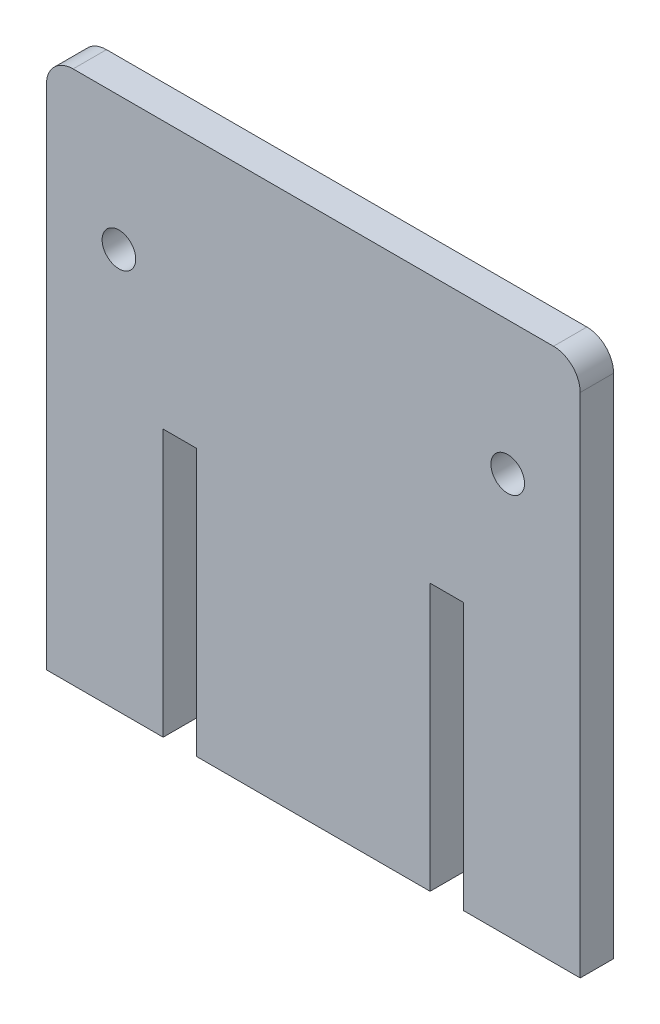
ISO-10303-21;
HEADER;
FILE_DESCRIPTION(('STEP AP214'),'2;1');
FILE_NAME('part.step','',(''),(''),'','','');
FILE_SCHEMA(('AUTOMOTIVE_DESIGN { 1 0 10303 214 1 1 1 1 }'));
ENDSEC;
DATA;
#1=APPLICATION_CONTEXT('core data for automotive mechanical design processes');
#2=APPLICATION_PROTOCOL_DEFINITION('international standard','automotive_design',2000,#1);
#3=PRODUCT_CONTEXT('',#1,'mechanical');
#4=PRODUCT('Part','Part','',(#3));
#5=PRODUCT_RELATED_PRODUCT_CATEGORY('part','',(#4));
#6=PRODUCT_DEFINITION_FORMATION('','',#4);
#7=PRODUCT_DEFINITION_CONTEXT('part definition',#1,'design');
#8=PRODUCT_DEFINITION('design','',#6,#7);
#9=PRODUCT_DEFINITION_SHAPE('','',#8);
#10=(LENGTH_UNIT() NAMED_UNIT(*) SI_UNIT(.MILLI.,.METRE.));
#11=(NAMED_UNIT(*) PLANE_ANGLE_UNIT() SI_UNIT($,.RADIAN.));
#12=(NAMED_UNIT(*) SI_UNIT($,.STERADIAN.) SOLID_ANGLE_UNIT());
#13=UNCERTAINTY_MEASURE_WITH_UNIT(LENGTH_MEASURE(1.E-05),#10,'distance_accuracy_value','');
#14=(GEOMETRIC_REPRESENTATION_CONTEXT(3) GLOBAL_UNCERTAINTY_ASSIGNED_CONTEXT((#13)) GLOBAL_UNIT_ASSIGNED_CONTEXT((#10,
#11,#12)) REPRESENTATION_CONTEXT('',''));
#15=CARTESIAN_POINT('',(0.,0.,0.));
#16=DIRECTION('',(0.,0.,1.));
#17=DIRECTION('',(1.,0.,0.));
#18=AXIS2_PLACEMENT_3D('',#15,#16,#17);
#19=CARTESIAN_POINT('',(-25.4,-25.4,1.5875));
#20=DIRECTION('',(0.,1.,0.));
#21=DIRECTION('',(0.,0.,1.));
#22=AXIS2_PLACEMENT_3D('',#19,#20,#21);
#23=PLANE('',#22);
#24=DIRECTION('',(1.,0.,0.));
#25=VECTOR('',#24,1.);
#26=CARTESIAN_POINT('',(-25.4,-25.4,1.5875));
#27=LINE('',#26,#25);
#28=CARTESIAN_POINT('',(14.2875,-25.4,1.5875));
#29=VERTEX_POINT('',#28);
#30=CARTESIAN_POINT('',(25.4,-25.4,1.5875));
#31=VERTEX_POINT('',#30);
#32=EDGE_CURVE('E213',#29,#31,#27,.T.);
#33=ORIENTED_EDGE('',*,*,#32,.F.);
#34=DIRECTION('',(0.,0.,1.));
#35=VECTOR('',#34,1.);
#36=CARTESIAN_POINT('',(14.2875,-25.4,-1.5875));
#37=LINE('',#36,#35);
#38=CARTESIAN_POINT('',(14.2875,-25.4,-1.5875));
#39=VERTEX_POINT('',#38);
#40=EDGE_CURVE('E173',#39,#29,#37,.T.);
#41=ORIENTED_EDGE('',*,*,#40,.F.);
#42=DIRECTION('',(1.,0.,0.));
#43=VECTOR('',#42,1.);
#44=CARTESIAN_POINT('',(-25.4,-25.4,-1.5875));
#45=LINE('',#44,#43);
#46=CARTESIAN_POINT('',(25.4,-25.4,-1.5875));
#47=VERTEX_POINT('',#46);
#48=EDGE_CURVE('E160',#39,#47,#45,.T.);
#49=ORIENTED_EDGE('',*,*,#48,.T.);
#50=DIRECTION('',(0.,0.,-1.));
#51=VECTOR('',#50,1.);
#52=CARTESIAN_POINT('',(25.4,-25.4,1.5875));
#53=LINE('',#52,#51);
#54=EDGE_CURVE('E217',#31,#47,#53,.T.);
#55=ORIENTED_EDGE('',*,*,#54,.F.);
#56=EDGE_LOOP('',(#33,#41,#49,#55));
#57=FACE_BOUND('',#56,.T.);
#58=ADVANCED_FACE('F32',(#57),#23,.F.);
#59=CARTESIAN_POINT('',(-11.1125,-25.4,-1.5875));
#60=VERTEX_POINT('',#59);
#61=CARTESIAN_POINT('',(11.1125,-25.4,-1.5875));
#62=VERTEX_POINT('',#61);
#63=EDGE_CURVE('E227',#60,#62,#45,.T.);
#64=ORIENTED_EDGE('',*,*,#63,.T.);
#65=DIRECTION('',(0.,0.,1.));
#66=VECTOR('',#65,1.);
#67=CARTESIAN_POINT('',(11.1125,-25.4,-1.5875));
#68=LINE('',#67,#66);
#69=CARTESIAN_POINT('',(11.1125,-25.4,1.5875));
#70=VERTEX_POINT('',#69);
#71=EDGE_CURVE('E176',#62,#70,#68,.T.);
#72=ORIENTED_EDGE('',*,*,#71,.T.);
#73=CARTESIAN_POINT('',(-11.1125,-25.4,1.5875));
#74=VERTEX_POINT('',#73);
#75=EDGE_CURVE('E218',#74,#70,#27,.T.);
#76=ORIENTED_EDGE('',*,*,#75,.F.);
#77=DIRECTION('',(0.,0.,1.));
#78=VECTOR('',#77,1.);
#79=CARTESIAN_POINT('',(-11.1125,-25.4,-1.5875));
#80=LINE('',#79,#78);
#81=EDGE_CURVE('E197',#60,#74,#80,.T.);
#82=ORIENTED_EDGE('',*,*,#81,.F.);
#83=EDGE_LOOP('',(#64,#72,#76,#82));
#84=FACE_BOUND('',#83,.T.);
#85=ADVANCED_FACE('F260',(#84),#23,.F.);
#86=CARTESIAN_POINT('',(25.4,25.4,1.5875));
#87=DIRECTION('',(-1.,0.,0.));
#88=DIRECTION('',(0.,-1.,0.));
#89=AXIS2_PLACEMENT_3D('',#86,#87,#88);
#90=PLANE('',#89);
#91=DIRECTION('',(0.,1.,0.));
#92=VECTOR('',#91,1.);
#93=CARTESIAN_POINT('',(25.4,25.4,-1.5875));
#94=LINE('',#93,#92);
#95=CARTESIAN_POINT('',(25.4,22.86,-1.5875));
#96=VERTEX_POINT('',#95);
#97=EDGE_CURVE('E199',#47,#96,#94,.T.);
#98=ORIENTED_EDGE('',*,*,#97,.T.);
#99=DIRECTION('',(0.,0.,-1.));
#100=VECTOR('',#99,1.);
#101=CARTESIAN_POINT('',(25.4,22.86,1.5875));
#102=LINE('',#101,#100);
#103=CARTESIAN_POINT('',(25.4,22.86,1.5875));
#104=VERTEX_POINT('',#103);
#105=EDGE_CURVE('E55',#96,#104,#102,.F.);
#106=ORIENTED_EDGE('',*,*,#105,.T.);
#107=DIRECTION('',(0.,1.,0.));
#108=VECTOR('',#107,1.);
#109=CARTESIAN_POINT('',(25.4,25.4,1.5875));
#110=LINE('',#109,#108);
#111=EDGE_CURVE('E206',#31,#104,#110,.T.);
#112=ORIENTED_EDGE('',*,*,#111,.F.);
#113=ORIENTED_EDGE('',*,*,#54,.T.);
#114=EDGE_LOOP('',(#98,#106,#112,#113));
#115=FACE_BOUND('',#114,.T.);
#116=ADVANCED_FACE('F252',(#115),#90,.F.);
#117=CARTESIAN_POINT('',(-25.4,25.4,1.5875));
#118=DIRECTION('',(0.,-1.,0.));
#119=DIRECTION('',(0.,0.,-1.));
#120=AXIS2_PLACEMENT_3D('',#117,#118,#119);
#121=PLANE('',#120);
#122=DIRECTION('',(-1.,0.,0.));
#123=VECTOR('',#122,1.);
#124=CARTESIAN_POINT('',(-25.4,25.4,1.5875));
#125=LINE('',#124,#123);
#126=CARTESIAN_POINT('',(22.86,25.4,1.5875));
#127=VERTEX_POINT('',#126);
#128=CARTESIAN_POINT('',(-22.86,25.4,1.5875));
#129=VERTEX_POINT('',#128);
#130=EDGE_CURVE('E208',#127,#129,#125,.T.);
#131=ORIENTED_EDGE('',*,*,#130,.F.);
#132=DIRECTION('',(0.,0.,-1.));
#133=VECTOR('',#132,1.);
#134=CARTESIAN_POINT('',(22.86,25.4,1.5875));
#135=LINE('',#134,#133);
#136=CARTESIAN_POINT('',(22.86,25.4,-1.5875));
#137=VERTEX_POINT('',#136);
#138=EDGE_CURVE('E235',#127,#137,#135,.T.);
#139=ORIENTED_EDGE('',*,*,#138,.T.);
#140=DIRECTION('',(-1.,0.,0.));
#141=VECTOR('',#140,1.);
#142=CARTESIAN_POINT('',(-25.4,25.4,-1.5875));
#143=LINE('',#142,#141);
#144=CARTESIAN_POINT('',(-22.86,25.4,-1.5875));
#145=VERTEX_POINT('',#144);
#146=EDGE_CURVE('E220',#137,#145,#143,.T.);
#147=ORIENTED_EDGE('',*,*,#146,.T.);
#148=DIRECTION('',(0.,0.,-1.));
#149=VECTOR('',#148,1.);
#150=CARTESIAN_POINT('',(-22.86,25.4,1.5875));
#151=LINE('',#150,#149);
#152=EDGE_CURVE('E233',#145,#129,#151,.F.);
#153=ORIENTED_EDGE('',*,*,#152,.T.);
#154=EDGE_LOOP('',(#131,#139,#147,#153));
#155=FACE_BOUND('',#154,.T.);
#156=ADVANCED_FACE('F249',(#155),#121,.F.);
#157=CARTESIAN_POINT('',(-25.4,25.4,1.5875));
#158=DIRECTION('',(1.,0.,0.));
#159=DIRECTION('',(0.,1.,0.));
#160=AXIS2_PLACEMENT_3D('',#157,#158,#159);
#161=PLANE('',#160);
#162=DIRECTION('',(0.,-1.,0.));
#163=VECTOR('',#162,1.);
#164=CARTESIAN_POINT('',(-25.4,25.4,1.5875));
#165=LINE('',#164,#163);
#166=CARTESIAN_POINT('',(-25.4,22.86,1.5875));
#167=VERTEX_POINT('',#166);
#168=CARTESIAN_POINT('',(-25.4,-25.4,1.5875));
#169=VERTEX_POINT('',#168);
#170=EDGE_CURVE('E211',#167,#169,#165,.T.);
#171=ORIENTED_EDGE('',*,*,#170,.F.);
#172=DIRECTION('',(0.,0.,-1.));
#173=VECTOR('',#172,1.);
#174=CARTESIAN_POINT('',(-25.4,22.86,1.5875));
#175=LINE('',#174,#173);
#176=CARTESIAN_POINT('',(-25.4,22.86,-1.5875));
#177=VERTEX_POINT('',#176);
#178=EDGE_CURVE('E11',#167,#177,#175,.T.);
#179=ORIENTED_EDGE('',*,*,#178,.T.);
#180=DIRECTION('',(0.,-1.,0.));
#181=VECTOR('',#180,1.);
#182=CARTESIAN_POINT('',(-25.4,25.4,-1.5875));
#183=LINE('',#182,#181);
#184=CARTESIAN_POINT('',(-25.4,-25.4,-1.5875));
#185=VERTEX_POINT('',#184);
#186=EDGE_CURVE('E223',#177,#185,#183,.T.);
#187=ORIENTED_EDGE('',*,*,#186,.T.);
#188=DIRECTION('',(0.,0.,-1.));
#189=VECTOR('',#188,1.);
#190=CARTESIAN_POINT('',(-25.4,-25.4,1.5875));
#191=LINE('',#190,#189);
#192=EDGE_CURVE('E230',#169,#185,#191,.T.);
#193=ORIENTED_EDGE('',*,*,#192,.F.);
#194=EDGE_LOOP('',(#171,#179,#187,#193));
#195=FACE_BOUND('',#194,.T.);
#196=ADVANCED_FACE('F283',(#195),#161,.F.);
#197=CARTESIAN_POINT('',(-14.2875,-25.4,-1.5875));
#198=VERTEX_POINT('',#197);
#199=EDGE_CURVE('E209',#185,#198,#45,.T.);
#200=ORIENTED_EDGE('',*,*,#199,.T.);
#201=DIRECTION('',(0.,0.,1.));
#202=VECTOR('',#201,1.);
#203=CARTESIAN_POINT('',(-14.2875,-25.4,-1.5875));
#204=LINE('',#203,#202);
#205=CARTESIAN_POINT('',(-14.2875,-25.4,1.5875));
#206=VERTEX_POINT('',#205);
#207=EDGE_CURVE('E200',#198,#206,#204,.T.);
#208=ORIENTED_EDGE('',*,*,#207,.T.);
#209=EDGE_CURVE('E214',#169,#206,#27,.T.);
#210=ORIENTED_EDGE('',*,*,#209,.F.);
#211=ORIENTED_EDGE('',*,*,#192,.T.);
#212=EDGE_LOOP('',(#200,#208,#210,#211));
#213=FACE_BOUND('',#212,.T.);
#214=ADVANCED_FACE('F279',(#213),#23,.F.);
#215=CARTESIAN_POINT('',(25.4,-25.4,1.5875));
#216=DIRECTION('',(0.,0.,1.));
#217=DIRECTION('',(1.,0.,0.));
#218=AXIS2_PLACEMENT_3D('',#215,#216,#217);
#219=PLANE('',#218);
#220=CARTESIAN_POINT('',(18.50136,12.7,1.5875));
#221=DIRECTION('',(0.,0.,1.));
#222=DIRECTION('',(-1.,0.,0.));
#223=AXIS2_PLACEMENT_3D('',#220,#221,#222);
#224=CIRCLE('',#223,1.6002);
#225=CARTESIAN_POINT('',(16.90116,12.7,1.5875));
#226=VERTEX_POINT('',#225);
#227=EDGE_CURVE('E437',#226,#226,#224,.T.);
#228=ORIENTED_EDGE('',*,*,#227,.F.);
#229=EDGE_LOOP('',(#228));
#230=FACE_BOUND('',#229,.T.);
#231=CARTESIAN_POINT('',(-18.50136,12.7,1.5875));
#232=DIRECTION('',(0.,0.,1.));
#233=DIRECTION('',(1.,0.,0.));
#234=AXIS2_PLACEMENT_3D('',#231,#232,#233);
#235=CIRCLE('',#234,1.6002);
#236=CARTESIAN_POINT('',(-16.90116,12.7,1.5875));
#237=VERTEX_POINT('',#236);
#238=EDGE_CURVE('E166',#237,#237,#235,.T.);
#239=ORIENTED_EDGE('',*,*,#238,.F.);
#240=EDGE_LOOP('',(#239));
#241=FACE_BOUND('',#240,.T.);
#242=ORIENTED_EDGE('',*,*,#111,.T.);
#243=CARTESIAN_POINT('',(22.86,22.86,1.5875));
#244=DIRECTION('',(0.,0.,1.));
#245=DIRECTION('',(1.,0.,0.));
#246=AXIS2_PLACEMENT_3D('',#243,#244,#245);
#247=CIRCLE('',#246,2.54);
#248=EDGE_CURVE('E40',#104,#127,#247,.T.);
#249=ORIENTED_EDGE('',*,*,#248,.T.);
#250=ORIENTED_EDGE('',*,*,#130,.T.);
#251=CARTESIAN_POINT('',(-22.86,22.86,1.5875));
#252=DIRECTION('',(0.,0.,1.));
#253=DIRECTION('',(1.,0.,0.));
#254=AXIS2_PLACEMENT_3D('',#251,#252,#253);
#255=CIRCLE('',#254,2.54);
#256=EDGE_CURVE('E47',#129,#167,#255,.T.);
#257=ORIENTED_EDGE('',*,*,#256,.T.);
#258=ORIENTED_EDGE('',*,*,#170,.T.);
#259=ORIENTED_EDGE('',*,*,#209,.T.);
#260=DIRECTION('',(0.,-1.,0.));
#261=VECTOR('',#260,1.);
#262=CARTESIAN_POINT('',(-14.2875,0.,1.5875));
#263=LINE('',#262,#261);
#264=CARTESIAN_POINT('',(-14.2875,0.,1.5875));
#265=VERTEX_POINT('',#264);
#266=EDGE_CURVE('E184',#265,#206,#263,.T.);
#267=ORIENTED_EDGE('',*,*,#266,.F.);
#268=DIRECTION('',(-1.,0.,0.));
#269=VECTOR('',#268,1.);
#270=CARTESIAN_POINT('',(-14.2875,0.,1.5875));
#271=LINE('',#270,#269);
#272=CARTESIAN_POINT('',(-11.1125,0.,1.5875));
#273=VERTEX_POINT('',#272);
#274=EDGE_CURVE('E193',#273,#265,#271,.T.);
#275=ORIENTED_EDGE('',*,*,#274,.F.);
#276=DIRECTION('',(0.,1.,0.));
#277=VECTOR('',#276,1.);
#278=CARTESIAN_POINT('',(-11.1125,0.,1.5875));
#279=LINE('',#278,#277);
#280=EDGE_CURVE('E175',#74,#273,#279,.T.);
#281=ORIENTED_EDGE('',*,*,#280,.F.);
#282=ORIENTED_EDGE('',*,*,#75,.T.);
#283=DIRECTION('',(0.,-1.,0.));
#284=VECTOR('',#283,1.);
#285=CARTESIAN_POINT('',(11.1125,0.,1.5875));
#286=LINE('',#285,#284);
#287=CARTESIAN_POINT('',(11.1125,0.,1.5875));
#288=VERTEX_POINT('',#287);
#289=EDGE_CURVE('E161',#288,#70,#286,.T.);
#290=ORIENTED_EDGE('',*,*,#289,.F.);
#291=DIRECTION('',(-1.,0.,0.));
#292=VECTOR('',#291,1.);
#293=CARTESIAN_POINT('',(14.2875,0.,1.5875));
#294=LINE('',#293,#292);
#295=CARTESIAN_POINT('',(14.2875,0.,1.5875));
#296=VERTEX_POINT('',#295);
#297=EDGE_CURVE('E163',#296,#288,#294,.T.);
#298=ORIENTED_EDGE('',*,*,#297,.F.);
#299=DIRECTION('',(0.,1.,0.));
#300=VECTOR('',#299,1.);
#301=CARTESIAN_POINT('',(14.2875,0.,1.5875));
#302=LINE('',#301,#300);
#303=EDGE_CURVE('E142',#29,#296,#302,.T.);
#304=ORIENTED_EDGE('',*,*,#303,.F.);
#305=ORIENTED_EDGE('',*,*,#32,.T.);
#306=EDGE_LOOP('',(#242,#249,#250,#257,#258,#259,#267,#275,#281,#282,#290,#298,#304,#305));
#307=FACE_BOUND('',#306,.T.);
#308=ADVANCED_FACE('F245',(#230,#241,#307),#219,.T.);
#309=CARTESIAN_POINT('',(25.4,-25.4,-1.5875));
#310=DIRECTION('',(0.,0.,1.));
#311=DIRECTION('',(1.,0.,0.));
#312=AXIS2_PLACEMENT_3D('',#309,#310,#311);
#313=PLANE('',#312);
#314=CARTESIAN_POINT('',(18.50136,12.7,-1.5875));
#315=DIRECTION('',(0.,0.,1.));
#316=DIRECTION('',(-1.,0.,0.));
#317=AXIS2_PLACEMENT_3D('',#314,#315,#316);
#318=CIRCLE('',#317,1.6002);
#319=CARTESIAN_POINT('',(16.90116,12.7,-1.5875));
#320=VERTEX_POINT('',#319);
#321=EDGE_CURVE('E434',#320,#320,#318,.T.);
#322=ORIENTED_EDGE('',*,*,#321,.T.);
#323=EDGE_LOOP('',(#322));
#324=FACE_BOUND('',#323,.T.);
#325=CARTESIAN_POINT('',(-18.50136,12.7,-1.5875));
#326=DIRECTION('',(0.,0.,1.));
#327=DIRECTION('',(1.,0.,0.));
#328=AXIS2_PLACEMENT_3D('',#325,#326,#327);
#329=CIRCLE('',#328,1.6002);
#330=CARTESIAN_POINT('',(-16.90116,12.7,-1.5875));
#331=VERTEX_POINT('',#330);
#332=EDGE_CURVE('E171',#331,#331,#329,.T.);
#333=ORIENTED_EDGE('',*,*,#332,.T.);
#334=EDGE_LOOP('',(#333));
#335=FACE_BOUND('',#334,.T.);
#336=ORIENTED_EDGE('',*,*,#146,.F.);
#337=CARTESIAN_POINT('',(22.86,22.86,-1.5875));
#338=DIRECTION('',(0.,0.,1.));
#339=DIRECTION('',(1.,0.,0.));
#340=AXIS2_PLACEMENT_3D('',#337,#338,#339);
#341=CIRCLE('',#340,2.54);
#342=EDGE_CURVE('E240',#137,#96,#341,.F.);
#343=ORIENTED_EDGE('',*,*,#342,.T.);
#344=ORIENTED_EDGE('',*,*,#97,.F.);
#345=ORIENTED_EDGE('',*,*,#48,.F.);
#346=DIRECTION('',(0.,1.,0.));
#347=VECTOR('',#346,1.);
#348=CARTESIAN_POINT('',(14.2875,0.,-1.5875));
#349=LINE('',#348,#347);
#350=CARTESIAN_POINT('',(14.2875,0.,-1.5875));
#351=VERTEX_POINT('',#350);
#352=EDGE_CURVE('E139',#39,#351,#349,.T.);
#353=ORIENTED_EDGE('',*,*,#352,.T.);
#354=DIRECTION('',(-1.,0.,0.));
#355=VECTOR('',#354,1.);
#356=CARTESIAN_POINT('',(14.2875,0.,-1.5875));
#357=LINE('',#356,#355);
#358=CARTESIAN_POINT('',(11.1125,0.,-1.5875));
#359=VERTEX_POINT('',#358);
#360=EDGE_CURVE('E151',#351,#359,#357,.T.);
#361=ORIENTED_EDGE('',*,*,#360,.T.);
#362=DIRECTION('',(0.,-1.,0.));
#363=VECTOR('',#362,1.);
#364=CARTESIAN_POINT('',(11.1125,0.,-1.5875));
#365=LINE('',#364,#363);
#366=EDGE_CURVE('E147',#359,#62,#365,.T.);
#367=ORIENTED_EDGE('',*,*,#366,.T.);
#368=ORIENTED_EDGE('',*,*,#63,.F.);
#369=DIRECTION('',(0.,1.,0.));
#370=VECTOR('',#369,1.);
#371=CARTESIAN_POINT('',(-11.1125,0.,-1.5875));
#372=LINE('',#371,#370);
#373=CARTESIAN_POINT('',(-11.1125,0.,-1.5875));
#374=VERTEX_POINT('',#373);
#375=EDGE_CURVE('E180',#60,#374,#372,.T.);
#376=ORIENTED_EDGE('',*,*,#375,.T.);
#377=DIRECTION('',(-1.,0.,0.));
#378=VECTOR('',#377,1.);
#379=CARTESIAN_POINT('',(-14.2875,0.,-1.5875));
#380=LINE('',#379,#378);
#381=CARTESIAN_POINT('',(-14.2875,0.,-1.5875));
#382=VERTEX_POINT('',#381);
#383=EDGE_CURVE('E183',#374,#382,#380,.T.);
#384=ORIENTED_EDGE('',*,*,#383,.T.);
#385=DIRECTION('',(0.,-1.,0.));
#386=VECTOR('',#385,1.);
#387=CARTESIAN_POINT('',(-14.2875,0.,-1.5875));
#388=LINE('',#387,#386);
#389=EDGE_CURVE('E187',#382,#198,#388,.T.);
#390=ORIENTED_EDGE('',*,*,#389,.T.);
#391=ORIENTED_EDGE('',*,*,#199,.F.);
#392=ORIENTED_EDGE('',*,*,#186,.F.);
#393=CARTESIAN_POINT('',(-22.86,22.86,-1.5875));
#394=DIRECTION('',(0.,0.,1.));
#395=DIRECTION('',(1.,0.,0.));
#396=AXIS2_PLACEMENT_3D('',#393,#394,#395);
#397=CIRCLE('',#396,2.54);
#398=EDGE_CURVE('E238',#177,#145,#397,.F.);
#399=ORIENTED_EDGE('',*,*,#398,.T.);
#400=EDGE_LOOP('',(#336,#343,#344,#345,#353,#361,#367,#368,#376,#384,#390,#391,#392,#399));
#401=FACE_BOUND('',#400,.T.);
#402=ADVANCED_FACE('F158',(#324,#335,#401),#313,.F.);
#403=CARTESIAN_POINT('',(-11.1125,0.,-1.5875));
#404=DIRECTION('',(1.,0.,0.));
#405=DIRECTION('',(0.,1.,0.));
#406=AXIS2_PLACEMENT_3D('',#403,#404,#405);
#407=PLANE('',#406);
#408=ORIENTED_EDGE('',*,*,#280,.T.);
#409=DIRECTION('',(0.,0.,1.));
#410=VECTOR('',#409,1.);
#411=CARTESIAN_POINT('',(-11.1125,0.,-1.5875));
#412=LINE('',#411,#410);
#413=EDGE_CURVE('E190',#374,#273,#412,.T.);
#414=ORIENTED_EDGE('',*,*,#413,.F.);
#415=ORIENTED_EDGE('',*,*,#375,.F.);
#416=ORIENTED_EDGE('',*,*,#81,.T.);
#417=EDGE_LOOP('',(#408,#414,#415,#416));
#418=FACE_BOUND('',#417,.T.);
#419=ADVANCED_FACE('F270',(#418),#407,.F.);
#420=CARTESIAN_POINT('',(-14.2875,0.,-1.5875));
#421=DIRECTION('',(-1.,0.,0.));
#422=DIRECTION('',(0.,-1.,0.));
#423=AXIS2_PLACEMENT_3D('',#420,#421,#422);
#424=PLANE('',#423);
#425=ORIENTED_EDGE('',*,*,#266,.T.);
#426=ORIENTED_EDGE('',*,*,#207,.F.);
#427=ORIENTED_EDGE('',*,*,#389,.F.);
#428=DIRECTION('',(0.,0.,1.));
#429=VECTOR('',#428,1.);
#430=CARTESIAN_POINT('',(-14.2875,0.,-1.5875));
#431=LINE('',#430,#429);
#432=EDGE_CURVE('E203',#382,#265,#431,.T.);
#433=ORIENTED_EDGE('',*,*,#432,.T.);
#434=EDGE_LOOP('',(#425,#426,#427,#433));
#435=FACE_BOUND('',#434,.T.);
#436=ADVANCED_FACE('F384',(#435),#424,.F.);
#437=CARTESIAN_POINT('',(-14.2875,0.,-1.5875));
#438=DIRECTION('',(0.,1.,0.));
#439=DIRECTION('',(0.,0.,1.));
#440=AXIS2_PLACEMENT_3D('',#437,#438,#439);
#441=PLANE('',#440);
#442=ORIENTED_EDGE('',*,*,#274,.T.);
#443=ORIENTED_EDGE('',*,*,#432,.F.);
#444=ORIENTED_EDGE('',*,*,#383,.F.);
#445=ORIENTED_EDGE('',*,*,#413,.T.);
#446=EDGE_LOOP('',(#442,#443,#444,#445));
#447=FACE_BOUND('',#446,.T.);
#448=ADVANCED_FACE('F274',(#447),#441,.F.);
#449=CARTESIAN_POINT('',(14.2875,0.,-1.5875));
#450=DIRECTION('',(1.,0.,0.));
#451=DIRECTION('',(0.,1.,0.));
#452=AXIS2_PLACEMENT_3D('',#449,#450,#451);
#453=PLANE('',#452);
#454=ORIENTED_EDGE('',*,*,#303,.T.);
#455=DIRECTION('',(0.,0.,1.));
#456=VECTOR('',#455,1.);
#457=CARTESIAN_POINT('',(14.2875,0.,-1.5875));
#458=LINE('',#457,#456);
#459=EDGE_CURVE('E135',#351,#296,#458,.T.);
#460=ORIENTED_EDGE('',*,*,#459,.F.);
#461=ORIENTED_EDGE('',*,*,#352,.F.);
#462=ORIENTED_EDGE('',*,*,#40,.T.);
#463=EDGE_LOOP('',(#454,#460,#461,#462));
#464=FACE_BOUND('',#463,.T.);
#465=ADVANCED_FACE('F137',(#464),#453,.F.);
#466=CARTESIAN_POINT('',(11.1125,0.,-1.5875));
#467=DIRECTION('',(-1.,0.,0.));
#468=DIRECTION('',(0.,-1.,0.));
#469=AXIS2_PLACEMENT_3D('',#466,#467,#468);
#470=PLANE('',#469);
#471=ORIENTED_EDGE('',*,*,#289,.T.);
#472=ORIENTED_EDGE('',*,*,#71,.F.);
#473=ORIENTED_EDGE('',*,*,#366,.F.);
#474=DIRECTION('',(0.,0.,1.));
#475=VECTOR('',#474,1.);
#476=CARTESIAN_POINT('',(11.1125,0.,-1.5875));
#477=LINE('',#476,#475);
#478=EDGE_CURVE('E146',#359,#288,#477,.T.);
#479=ORIENTED_EDGE('',*,*,#478,.T.);
#480=EDGE_LOOP('',(#471,#472,#473,#479));
#481=FACE_BOUND('',#480,.T.);
#482=ADVANCED_FACE('F264',(#481),#470,.F.);
#483=CARTESIAN_POINT('',(14.2875,0.,-1.5875));
#484=DIRECTION('',(0.,1.,0.));
#485=DIRECTION('',(0.,0.,1.));
#486=AXIS2_PLACEMENT_3D('',#483,#484,#485);
#487=PLANE('',#486);
#488=ORIENTED_EDGE('',*,*,#297,.T.);
#489=ORIENTED_EDGE('',*,*,#478,.F.);
#490=ORIENTED_EDGE('',*,*,#360,.F.);
#491=ORIENTED_EDGE('',*,*,#459,.T.);
#492=EDGE_LOOP('',(#488,#489,#490,#491));
#493=FACE_BOUND('',#492,.T.);
#494=ADVANCED_FACE('F152',(#493),#487,.F.);
#495=CARTESIAN_POINT('',(22.86,22.86,1.5875));
#496=DIRECTION('',(0.,0.,-1.));
#497=DIRECTION('',(-1.,0.,0.));
#498=AXIS2_PLACEMENT_3D('',#495,#496,#497);
#499=CYLINDRICAL_SURFACE('',#498,2.54);
#500=ORIENTED_EDGE('',*,*,#248,.F.);
#501=ORIENTED_EDGE('',*,*,#105,.F.);
#502=ORIENTED_EDGE('',*,*,#342,.F.);
#503=ORIENTED_EDGE('',*,*,#138,.F.);
#504=EDGE_LOOP('',(#500,#501,#502,#503));
#505=FACE_BOUND('',#504,.T.);
#506=ADVANCED_FACE('F251',(#505),#499,.T.);
#507=CARTESIAN_POINT('',(-22.86,22.86,1.5875));
#508=DIRECTION('',(0.,0.,-1.));
#509=DIRECTION('',(-1.,0.,0.));
#510=AXIS2_PLACEMENT_3D('',#507,#508,#509);
#511=CYLINDRICAL_SURFACE('',#510,2.54);
#512=ORIENTED_EDGE('',*,*,#256,.F.);
#513=ORIENTED_EDGE('',*,*,#152,.F.);
#514=ORIENTED_EDGE('',*,*,#398,.F.);
#515=ORIENTED_EDGE('',*,*,#178,.F.);
#516=EDGE_LOOP('',(#512,#513,#514,#515));
#517=FACE_BOUND('',#516,.T.);
#518=ADVANCED_FACE('F34',(#517),#511,.T.);
#519=CARTESIAN_POINT('',(-18.50136,12.7,-1.5875));
#520=DIRECTION('',(0.,0.,1.));
#521=DIRECTION('',(1.,0.,0.));
#522=AXIS2_PLACEMENT_3D('',#519,#520,#521);
#523=CYLINDRICAL_SURFACE('',#522,1.6002);
#524=ORIENTED_EDGE('',*,*,#332,.F.);
#525=EDGE_LOOP('',(#524));
#526=FACE_BOUND('',#525,.T.);
#527=ORIENTED_EDGE('',*,*,#238,.T.);
#528=EDGE_LOOP('',(#527));
#529=FACE_BOUND('',#528,.T.);
#530=ADVANCED_FACE('F287',(#526,#529),#523,.F.);
#531=CARTESIAN_POINT('',(18.50136,12.7,-1.5875));
#532=DIRECTION('',(0.,0.,1.));
#533=DIRECTION('',(1.,0.,0.));
#534=AXIS2_PLACEMENT_3D('',#531,#532,#533);
#535=CYLINDRICAL_SURFACE('',#534,1.6002);
#536=ORIENTED_EDGE('',*,*,#321,.F.);
#537=EDGE_LOOP('',(#536));
#538=FACE_BOUND('',#537,.T.);
#539=ORIENTED_EDGE('',*,*,#227,.T.);
#540=EDGE_LOOP('',(#539));
#541=FACE_BOUND('',#540,.T.);
#542=ADVANCED_FACE('F292',(#538,#541),#535,.F.);
#543=CLOSED_SHELL('',(#58,#85,#116,#156,#196,#214,#308,#402,#419,#436,#448,#465,#482,#494,#506,
#518,#530,#542));
#544=MANIFOLD_SOLID_BREP('B2',#543);
#545=ADVANCED_BREP_SHAPE_REPRESENTATION('',(#18,#544),#14);
#546=SHAPE_DEFINITION_REPRESENTATION(#9,#545);
ENDSEC;
END-ISO-10303-21;
